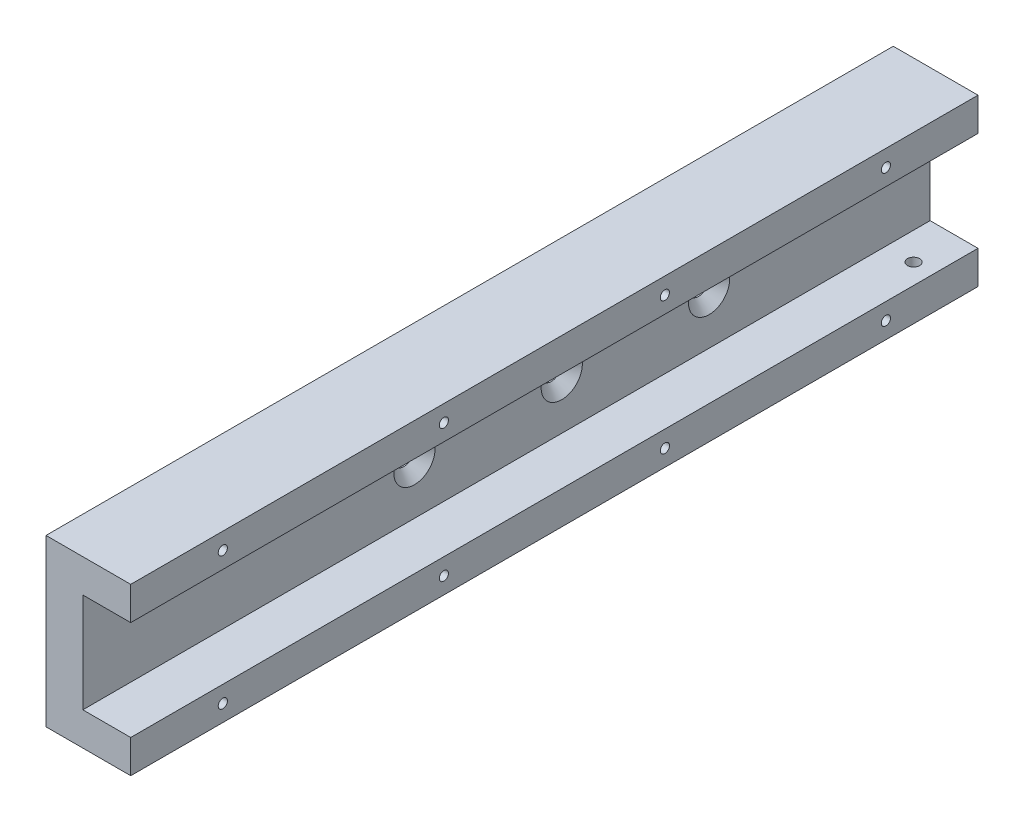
ISO-10303-21;
HEADER;
FILE_DESCRIPTION(('STEP AP214'),'2;1');
FILE_NAME('part.step','',(''),(''),'','','');
FILE_SCHEMA(('AUTOMOTIVE_DESIGN { 1 0 10303 214 1 1 1 1 }'));
ENDSEC;
DATA;
#1=APPLICATION_CONTEXT('core data for automotive mechanical design processes');
#2=APPLICATION_PROTOCOL_DEFINITION('international standard','automotive_design',2000,#1);
#3=PRODUCT_CONTEXT('',#1,'mechanical');
#4=PRODUCT('Part','Part','',(#3));
#5=PRODUCT_RELATED_PRODUCT_CATEGORY('part','',(#4));
#6=PRODUCT_DEFINITION_FORMATION('','',#4);
#7=PRODUCT_DEFINITION_CONTEXT('part definition',#1,'design');
#8=PRODUCT_DEFINITION('design','',#6,#7);
#9=PRODUCT_DEFINITION_SHAPE('','',#8);
#10=(LENGTH_UNIT() NAMED_UNIT(*) SI_UNIT(.MILLI.,.METRE.));
#11=(NAMED_UNIT(*) PLANE_ANGLE_UNIT() SI_UNIT($,.RADIAN.));
#12=(NAMED_UNIT(*) SI_UNIT($,.STERADIAN.) SOLID_ANGLE_UNIT());
#13=UNCERTAINTY_MEASURE_WITH_UNIT(LENGTH_MEASURE(1.E-05),#10,'distance_accuracy_value','');
#14=(GEOMETRIC_REPRESENTATION_CONTEXT(3) GLOBAL_UNCERTAINTY_ASSIGNED_CONTEXT((#13)) GLOBAL_UNIT_ASSIGNED_CONTEXT((#10,
#11,#12)) REPRESENTATION_CONTEXT('',''));
#15=CARTESIAN_POINT('',(0.,0.,0.));
#16=DIRECTION('',(0.,0.,1.));
#17=DIRECTION('',(1.,0.,0.));
#18=AXIS2_PLACEMENT_3D('',#15,#16,#17);
#19=CARTESIAN_POINT('',(95.0000000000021,-13.3541654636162,230.));
#20=DIRECTION('',(1.,0.,0.));
#21=DIRECTION('',(0.,0.,-1.));
#22=AXIS2_PLACEMENT_3D('',#19,#20,#21);
#23=PLANE('',#22);
#24=CARTESIAN_POINT('',(95.0000000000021,9.14583453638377,60.));
#25=DIRECTION('',(1.,0.,0.));
#26=DIRECTION('',(0.,0.,-1.));
#27=AXIS2_PLACEMENT_3D('',#24,#25,#26);
#28=CIRCLE('',#27,2.75);
#29=CARTESIAN_POINT('',(95.0000000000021,9.14583453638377,57.25));
#30=VERTEX_POINT('',#29);
#31=EDGE_CURVE('E240',#30,#30,#28,.T.);
#32=ORIENTED_EDGE('',*,*,#31,.T.);
#33=EDGE_LOOP('',(#32));
#34=FACE_BOUND('',#33,.T.);
#35=CARTESIAN_POINT('',(95.0000000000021,9.14583453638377,100.));
#36=DIRECTION('',(1.,0.,0.));
#37=DIRECTION('',(0.,0.,-1.));
#38=AXIS2_PLACEMENT_3D('',#35,#36,#37);
#39=CIRCLE('',#38,2.75);
#40=CARTESIAN_POINT('',(95.0000000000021,9.14583453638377,97.25));
#41=VERTEX_POINT('',#40);
#42=EDGE_CURVE('E231',#41,#41,#39,.T.);
#43=ORIENTED_EDGE('',*,*,#42,.T.);
#44=EDGE_LOOP('',(#43));
#45=FACE_BOUND('',#44,.T.);
#46=CARTESIAN_POINT('',(95.0000000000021,9.14583453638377,140.));
#47=DIRECTION('',(1.,0.,0.));
#48=DIRECTION('',(0.,0.,-1.));
#49=AXIS2_PLACEMENT_3D('',#46,#47,#48);
#50=CIRCLE('',#49,2.75);
#51=CARTESIAN_POINT('',(95.0000000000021,9.14583453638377,137.25));
#52=VERTEX_POINT('',#51);
#53=EDGE_CURVE('E222',#52,#52,#50,.T.);
#54=ORIENTED_EDGE('',*,*,#53,.T.);
#55=EDGE_LOOP('',(#54));
#56=FACE_BOUND('',#55,.T.);
#57=DIRECTION('',(0.,-1.,0.));
#58=VECTOR('',#57,1.);
#59=CARTESIAN_POINT('',(95.0000000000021,-13.3541654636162,0.));
#60=LINE('',#59,#58);
#61=CARTESIAN_POINT('',(95.0000000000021,31.6458345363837,0.));
#62=VERTEX_POINT('',#61);
#63=CARTESIAN_POINT('',(95.0000000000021,-13.3541654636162,0.));
#64=VERTEX_POINT('',#63);
#65=EDGE_CURVE('E115',#62,#64,#60,.T.);
#66=ORIENTED_EDGE('',*,*,#65,.T.);
#67=DIRECTION('',(0.,0.,-1.));
#68=VECTOR('',#67,1.);
#69=CARTESIAN_POINT('',(95.0000000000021,-13.3541654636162,230.));
#70=LINE('',#69,#68);
#71=CARTESIAN_POINT('',(95.0000000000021,-13.3541654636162,230.));
#72=VERTEX_POINT('',#71);
#73=EDGE_CURVE('E11',#72,#64,#70,.T.);
#74=ORIENTED_EDGE('',*,*,#73,.F.);
#75=DIRECTION('',(0.,-1.,0.));
#76=VECTOR('',#75,1.);
#77=CARTESIAN_POINT('',(95.0000000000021,-13.3541654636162,230.));
#78=LINE('',#77,#76);
#79=CARTESIAN_POINT('',(95.0000000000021,31.6458345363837,230.));
#80=VERTEX_POINT('',#79);
#81=EDGE_CURVE('E130',#80,#72,#78,.T.);
#82=ORIENTED_EDGE('',*,*,#81,.F.);
#83=DIRECTION('',(0.,0.,-1.));
#84=VECTOR('',#83,1.);
#85=CARTESIAN_POINT('',(95.0000000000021,31.6458345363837,230.));
#86=LINE('',#85,#84);
#87=EDGE_CURVE('E111',#80,#62,#86,.T.);
#88=ORIENTED_EDGE('',*,*,#87,.T.);
#89=EDGE_LOOP('',(#66,#74,#82,#88));
#90=FACE_BOUND('',#89,.T.);
#91=ADVANCED_FACE('F16',(#34,#45,#56,#90),#23,.F.);
#92=CARTESIAN_POINT('',(95.0000000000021,-13.3541654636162,230.));
#93=DIRECTION('',(0.,1.,0.));
#94=DIRECTION('',(0.,0.,1.));
#95=AXIS2_PLACEMENT_3D('',#92,#93,#94);
#96=PLANE('',#95);
#97=CARTESIAN_POINT('',(112.5,-13.3541654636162,12.0000000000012));
#98=DIRECTION('',(0.,-1.,0.));
#99=DIRECTION('',(0.,0.,-1.));
#100=AXIS2_PLACEMENT_3D('',#97,#98,#99);
#101=CIRCLE('',#100,1.65);
#102=CARTESIAN_POINT('',(112.5,-13.3541654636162,10.3500000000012));
#103=VERTEX_POINT('',#102);
#104=EDGE_CURVE('E219',#103,#103,#101,.T.);
#105=ORIENTED_EDGE('',*,*,#104,.F.);
#106=EDGE_LOOP('',(#105));
#107=FACE_BOUND('',#106,.T.);
#108=CARTESIAN_POINT('',(100.500000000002,-13.3541654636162,12.0000000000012));
#109=DIRECTION('',(0.,-1.,0.));
#110=DIRECTION('',(0.,0.,-1.));
#111=AXIS2_PLACEMENT_3D('',#108,#109,#110);
#112=CIRCLE('',#111,1.65);
#113=CARTESIAN_POINT('',(100.500000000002,-13.3541654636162,10.3500000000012));
#114=VERTEX_POINT('',#113);
#115=EDGE_CURVE('E213',#114,#114,#112,.T.);
#116=ORIENTED_EDGE('',*,*,#115,.F.);
#117=EDGE_LOOP('',(#116));
#118=FACE_BOUND('',#117,.T.);
#119=DIRECTION('',(1.,0.,0.));
#120=VECTOR('',#119,1.);
#121=CARTESIAN_POINT('',(95.0000000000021,-13.3541654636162,0.));
#122=LINE('',#121,#120);
#123=CARTESIAN_POINT('',(118.000000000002,-13.3541654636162,0.));
#124=VERTEX_POINT('',#123);
#125=EDGE_CURVE('E118',#64,#124,#122,.T.);
#126=ORIENTED_EDGE('',*,*,#125,.T.);
#127=DIRECTION('',(0.,0.,-1.));
#128=VECTOR('',#127,1.);
#129=CARTESIAN_POINT('',(118.000000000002,-13.3541654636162,230.));
#130=LINE('',#129,#128);
#131=CARTESIAN_POINT('',(118.000000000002,-13.3541654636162,230.));
#132=VERTEX_POINT('',#131);
#133=EDGE_CURVE('E24',#132,#124,#130,.T.);
#134=ORIENTED_EDGE('',*,*,#133,.F.);
#135=DIRECTION('',(1.,0.,0.));
#136=VECTOR('',#135,1.);
#137=CARTESIAN_POINT('',(95.0000000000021,-13.3541654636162,230.));
#138=LINE('',#137,#136);
#139=EDGE_CURVE('E76',#72,#132,#138,.T.);
#140=ORIENTED_EDGE('',*,*,#139,.F.);
#141=ORIENTED_EDGE('',*,*,#73,.T.);
#142=EDGE_LOOP('',(#126,#134,#140,#141));
#143=FACE_BOUND('',#142,.T.);
#144=ADVANCED_FACE('F279',(#107,#118,#143),#96,.F.);
#145=CARTESIAN_POINT('',(118.000000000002,-13.3541654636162,230.));
#146=DIRECTION('',(-1.,0.,0.));
#147=DIRECTION('',(0.,0.,1.));
#148=AXIS2_PLACEMENT_3D('',#145,#146,#147);
#149=PLANE('',#148);
#150=CARTESIAN_POINT('',(118.000000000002,-8.85416546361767,205.));
#151=DIRECTION('',(1.,0.,0.));
#152=DIRECTION('',(0.,0.,-1.));
#153=AXIS2_PLACEMENT_3D('',#150,#151,#152);
#154=CIRCLE('',#153,1.25);
#155=CARTESIAN_POINT('',(118.000000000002,-8.85416546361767,203.75));
#156=VERTEX_POINT('',#155);
#157=EDGE_CURVE('E183',#156,#156,#154,.T.);
#158=ORIENTED_EDGE('',*,*,#157,.F.);
#159=EDGE_LOOP('',(#158));
#160=FACE_BOUND('',#159,.T.);
#161=CARTESIAN_POINT('',(118.000000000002,-8.85416546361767,145.));
#162=DIRECTION('',(1.,0.,0.));
#163=DIRECTION('',(0.,0.,-1.));
#164=AXIS2_PLACEMENT_3D('',#161,#162,#163);
#165=CIRCLE('',#164,1.25);
#166=CARTESIAN_POINT('',(118.000000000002,-8.85416546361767,143.75));
#167=VERTEX_POINT('',#166);
#168=EDGE_CURVE('E177',#167,#167,#165,.T.);
#169=ORIENTED_EDGE('',*,*,#168,.F.);
#170=EDGE_LOOP('',(#169));
#171=FACE_BOUND('',#170,.T.);
#172=CARTESIAN_POINT('',(118.000000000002,-8.85416546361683,85.));
#173=DIRECTION('',(1.,0.,0.));
#174=DIRECTION('',(0.,0.,-1.));
#175=AXIS2_PLACEMENT_3D('',#172,#173,#174);
#176=CIRCLE('',#175,1.25);
#177=CARTESIAN_POINT('',(118.000000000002,-8.85416546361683,83.75));
#178=VERTEX_POINT('',#177);
#179=EDGE_CURVE('E171',#178,#178,#176,.T.);
#180=ORIENTED_EDGE('',*,*,#179,.F.);
#181=EDGE_LOOP('',(#180));
#182=FACE_BOUND('',#181,.T.);
#183=CARTESIAN_POINT('',(118.000000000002,-8.85416546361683,25.));
#184=DIRECTION('',(1.,0.,0.));
#185=DIRECTION('',(0.,0.,-1.));
#186=AXIS2_PLACEMENT_3D('',#183,#184,#185);
#187=CIRCLE('',#186,1.25);
#188=CARTESIAN_POINT('',(118.000000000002,-8.85416546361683,23.75));
#189=VERTEX_POINT('',#188);
#190=EDGE_CURVE('E165',#189,#189,#187,.T.);
#191=ORIENTED_EDGE('',*,*,#190,.F.);
#192=EDGE_LOOP('',(#191));
#193=FACE_BOUND('',#192,.T.);
#194=DIRECTION('',(0.,1.,0.));
#195=VECTOR('',#194,1.);
#196=CARTESIAN_POINT('',(118.000000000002,-13.3541654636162,0.));
#197=LINE('',#196,#195);
#198=CARTESIAN_POINT('',(118.000000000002,-4.35416546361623,0.));
#199=VERTEX_POINT('',#198);
#200=EDGE_CURVE('E121',#124,#199,#197,.T.);
#201=ORIENTED_EDGE('',*,*,#200,.T.);
#202=DIRECTION('',(0.,0.,-1.));
#203=VECTOR('',#202,1.);
#204=CARTESIAN_POINT('',(118.000000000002,-4.35416546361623,230.));
#205=LINE('',#204,#203);
#206=CARTESIAN_POINT('',(118.000000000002,-4.35416546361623,230.));
#207=VERTEX_POINT('',#206);
#208=EDGE_CURVE('E137',#207,#199,#205,.T.);
#209=ORIENTED_EDGE('',*,*,#208,.F.);
#210=DIRECTION('',(0.,1.,0.));
#211=VECTOR('',#210,1.);
#212=CARTESIAN_POINT('',(118.000000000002,-13.3541654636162,230.));
#213=LINE('',#212,#211);
#214=EDGE_CURVE('E145',#132,#207,#213,.T.);
#215=ORIENTED_EDGE('',*,*,#214,.F.);
#216=ORIENTED_EDGE('',*,*,#133,.T.);
#217=EDGE_LOOP('',(#201,#209,#215,#216));
#218=FACE_BOUND('',#217,.T.);
#219=ADVANCED_FACE('F143',(#160,#171,#182,#193,#218),#149,.F.);
#220=CARTESIAN_POINT('',(118.000000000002,-4.35416546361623,230.));
#221=DIRECTION('',(0.,-1.,0.));
#222=DIRECTION('',(1.,0.,0.));
#223=AXIS2_PLACEMENT_3D('',#220,#221,#222);
#224=PLANE('',#223);
#225=CARTESIAN_POINT('',(112.5,-4.35416546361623,12.0000000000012));
#226=DIRECTION('',(0.,-1.,0.));
#227=DIRECTION('',(1.,0.,0.));
#228=AXIS2_PLACEMENT_3D('',#225,#226,#227);
#229=CIRCLE('',#228,1.65);
#230=CARTESIAN_POINT('',(114.15,-4.35416546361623,12.0000000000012));
#231=VERTEX_POINT('',#230);
#232=EDGE_CURVE('E216',#231,#231,#229,.T.);
#233=ORIENTED_EDGE('',*,*,#232,.T.);
#234=EDGE_LOOP('',(#233));
#235=FACE_BOUND('',#234,.T.);
#236=DIRECTION('',(-1.,0.,0.));
#237=VECTOR('',#236,1.);
#238=CARTESIAN_POINT('',(118.000000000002,-4.35416546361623,0.));
#239=LINE('',#238,#237);
#240=CARTESIAN_POINT('',(105.000000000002,-4.35416546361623,0.));
#241=VERTEX_POINT('',#240);
#242=EDGE_CURVE('E123',#199,#241,#239,.T.);
#243=ORIENTED_EDGE('',*,*,#242,.T.);
#244=DIRECTION('',(0.,0.,-1.));
#245=VECTOR('',#244,1.);
#246=CARTESIAN_POINT('',(105.000000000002,-4.35416546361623,230.));
#247=LINE('',#246,#245);
#248=CARTESIAN_POINT('',(105.000000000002,-4.35416546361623,230.));
#249=VERTEX_POINT('',#248);
#250=EDGE_CURVE('E134',#249,#241,#247,.T.);
#251=ORIENTED_EDGE('',*,*,#250,.F.);
#252=DIRECTION('',(-1.,0.,0.));
#253=VECTOR('',#252,1.);
#254=CARTESIAN_POINT('',(118.000000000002,-4.35416546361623,230.));
#255=LINE('',#254,#253);
#256=EDGE_CURVE('E157',#207,#249,#255,.T.);
#257=ORIENTED_EDGE('',*,*,#256,.F.);
#258=ORIENTED_EDGE('',*,*,#208,.T.);
#259=EDGE_LOOP('',(#243,#251,#257,#258));
#260=FACE_BOUND('',#259,.T.);
#261=ADVANCED_FACE('F153',(#235,#260),#224,.F.);
#262=CARTESIAN_POINT('',(105.000000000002,-4.35416546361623,230.));
#263=DIRECTION('',(-1.,0.,0.));
#264=DIRECTION('',(0.,0.,1.));
#265=AXIS2_PLACEMENT_3D('',#262,#263,#264);
#266=PLANE('',#265);
#267=CARTESIAN_POINT('',(105.000000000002,9.14583453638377,60.));
#268=DIRECTION('',(1.,0.,0.));
#269=DIRECTION('',(0.,0.,-1.));
#270=AXIS2_PLACEMENT_3D('',#267,#268,#269);
#271=CIRCLE('',#270,5.6);
#272=CARTESIAN_POINT('',(105.000000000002,9.14583453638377,54.4));
#273=VERTEX_POINT('',#272);
#274=EDGE_CURVE('E246',#273,#273,#271,.T.);
#275=ORIENTED_EDGE('',*,*,#274,.F.);
#276=EDGE_LOOP('',(#275));
#277=FACE_BOUND('',#276,.T.);
#278=CARTESIAN_POINT('',(105.000000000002,9.14583453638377,100.));
#279=DIRECTION('',(1.,0.,0.));
#280=DIRECTION('',(0.,0.,-1.));
#281=AXIS2_PLACEMENT_3D('',#278,#279,#280);
#282=CIRCLE('',#281,5.6);
#283=CARTESIAN_POINT('',(105.000000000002,9.14583453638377,94.4));
#284=VERTEX_POINT('',#283);
#285=EDGE_CURVE('E237',#284,#284,#282,.T.);
#286=ORIENTED_EDGE('',*,*,#285,.F.);
#287=EDGE_LOOP('',(#286));
#288=FACE_BOUND('',#287,.T.);
#289=CARTESIAN_POINT('',(105.000000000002,9.14583453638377,140.));
#290=DIRECTION('',(1.,0.,0.));
#291=DIRECTION('',(0.,0.,-1.));
#292=AXIS2_PLACEMENT_3D('',#289,#290,#291);
#293=CIRCLE('',#292,5.6);
#294=CARTESIAN_POINT('',(105.000000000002,9.14583453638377,134.4));
#295=VERTEX_POINT('',#294);
#296=EDGE_CURVE('E228',#295,#295,#293,.T.);
#297=ORIENTED_EDGE('',*,*,#296,.F.);
#298=EDGE_LOOP('',(#297));
#299=FACE_BOUND('',#298,.T.);
#300=DIRECTION('',(0.,1.,0.));
#301=VECTOR('',#300,1.);
#302=CARTESIAN_POINT('',(105.000000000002,-4.35416546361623,0.));
#303=LINE('',#302,#301);
#304=CARTESIAN_POINT('',(105.000000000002,22.6458345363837,0.));
#305=VERTEX_POINT('',#304);
#306=EDGE_CURVE('E125',#241,#305,#303,.T.);
#307=ORIENTED_EDGE('',*,*,#306,.T.);
#308=DIRECTION('',(0.,0.,-1.));
#309=VECTOR('',#308,1.);
#310=CARTESIAN_POINT('',(105.000000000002,22.6458345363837,230.));
#311=LINE('',#310,#309);
#312=CARTESIAN_POINT('',(105.000000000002,22.6458345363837,230.));
#313=VERTEX_POINT('',#312);
#314=EDGE_CURVE('E106',#313,#305,#311,.T.);
#315=ORIENTED_EDGE('',*,*,#314,.F.);
#316=DIRECTION('',(0.,1.,0.));
#317=VECTOR('',#316,1.);
#318=CARTESIAN_POINT('',(105.000000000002,-4.35416546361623,230.));
#319=LINE('',#318,#317);
#320=EDGE_CURVE('E97',#249,#313,#319,.T.);
#321=ORIENTED_EDGE('',*,*,#320,.F.);
#322=ORIENTED_EDGE('',*,*,#250,.T.);
#323=EDGE_LOOP('',(#307,#315,#321,#322));
#324=FACE_BOUND('',#323,.T.);
#325=ADVANCED_FACE('F156',(#277,#288,#299,#324),#266,.F.);
#326=CARTESIAN_POINT('',(118.000000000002,22.6458345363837,230.));
#327=DIRECTION('',(0.,1.,0.));
#328=DIRECTION('',(0.,0.,1.));
#329=AXIS2_PLACEMENT_3D('',#326,#327,#328);
#330=PLANE('',#329);
#331=DIRECTION('',(1.,0.,0.));
#332=VECTOR('',#331,1.);
#333=CARTESIAN_POINT('',(118.000000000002,22.6458345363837,0.));
#334=LINE('',#333,#332);
#335=CARTESIAN_POINT('',(118.000000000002,22.6458345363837,0.));
#336=VERTEX_POINT('',#335);
#337=EDGE_CURVE('E105',#305,#336,#334,.T.);
#338=ORIENTED_EDGE('',*,*,#337,.T.);
#339=DIRECTION('',(0.,0.,-1.));
#340=VECTOR('',#339,1.);
#341=CARTESIAN_POINT('',(118.000000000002,22.6458345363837,230.));
#342=LINE('',#341,#340);
#343=CARTESIAN_POINT('',(118.000000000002,22.6458345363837,230.));
#344=VERTEX_POINT('',#343);
#345=EDGE_CURVE('E102',#344,#336,#342,.T.);
#346=ORIENTED_EDGE('',*,*,#345,.F.);
#347=DIRECTION('',(1.,0.,0.));
#348=VECTOR('',#347,1.);
#349=CARTESIAN_POINT('',(118.000000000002,22.6458345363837,230.));
#350=LINE('',#349,#348);
#351=EDGE_CURVE('E91',#313,#344,#350,.T.);
#352=ORIENTED_EDGE('',*,*,#351,.F.);
#353=ORIENTED_EDGE('',*,*,#314,.T.);
#354=EDGE_LOOP('',(#338,#346,#352,#353));
#355=FACE_BOUND('',#354,.T.);
#356=ADVANCED_FACE('F103',(#355),#330,.F.);
#357=CARTESIAN_POINT('',(118.000000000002,22.6458345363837,230.));
#358=DIRECTION('',(-1.,0.,0.));
#359=DIRECTION('',(0.,-1.,0.));
#360=AXIS2_PLACEMENT_3D('',#357,#358,#359);
#361=PLANE('',#360);
#362=CARTESIAN_POINT('',(118.000000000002,27.1458345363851,25.));
#363=DIRECTION('',(1.,0.,0.));
#364=DIRECTION('',(0.,0.,-1.));
#365=AXIS2_PLACEMENT_3D('',#362,#363,#364);
#366=CIRCLE('',#365,1.24999999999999);
#367=CARTESIAN_POINT('',(118.000000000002,27.1458345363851,23.75));
#368=VERTEX_POINT('',#367);
#369=EDGE_CURVE('E207',#368,#368,#366,.T.);
#370=ORIENTED_EDGE('',*,*,#369,.F.);
#371=EDGE_LOOP('',(#370));
#372=FACE_BOUND('',#371,.T.);
#373=CARTESIAN_POINT('',(118.000000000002,27.1458345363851,85.));
#374=DIRECTION('',(1.,0.,0.));
#375=DIRECTION('',(0.,0.,-1.));
#376=AXIS2_PLACEMENT_3D('',#373,#374,#375);
#377=CIRCLE('',#376,1.24999999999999);
#378=CARTESIAN_POINT('',(118.000000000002,27.1458345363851,83.75));
#379=VERTEX_POINT('',#378);
#380=EDGE_CURVE('E201',#379,#379,#377,.T.);
#381=ORIENTED_EDGE('',*,*,#380,.F.);
#382=EDGE_LOOP('',(#381));
#383=FACE_BOUND('',#382,.T.);
#384=CARTESIAN_POINT('',(118.000000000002,27.1458345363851,145.));
#385=DIRECTION('',(1.,0.,0.));
#386=DIRECTION('',(0.,0.,-1.));
#387=AXIS2_PLACEMENT_3D('',#384,#385,#386);
#388=CIRCLE('',#387,1.24999999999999);
#389=CARTESIAN_POINT('',(118.000000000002,27.1458345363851,143.75));
#390=VERTEX_POINT('',#389);
#391=EDGE_CURVE('E195',#390,#390,#388,.T.);
#392=ORIENTED_EDGE('',*,*,#391,.F.);
#393=EDGE_LOOP('',(#392));
#394=FACE_BOUND('',#393,.T.);
#395=CARTESIAN_POINT('',(118.000000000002,27.1458345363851,205.));
#396=DIRECTION('',(1.,0.,0.));
#397=DIRECTION('',(0.,0.,-1.));
#398=AXIS2_PLACEMENT_3D('',#395,#396,#397);
#399=CIRCLE('',#398,1.24999999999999);
#400=CARTESIAN_POINT('',(118.000000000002,27.1458345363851,203.75));
#401=VERTEX_POINT('',#400);
#402=EDGE_CURVE('E189',#401,#401,#399,.T.);
#403=ORIENTED_EDGE('',*,*,#402,.F.);
#404=EDGE_LOOP('',(#403));
#405=FACE_BOUND('',#404,.T.);
#406=DIRECTION('',(0.,1.,0.));
#407=VECTOR('',#406,1.);
#408=CARTESIAN_POINT('',(118.000000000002,22.6458345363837,0.));
#409=LINE('',#408,#407);
#410=CARTESIAN_POINT('',(118.000000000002,31.6458345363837,0.));
#411=VERTEX_POINT('',#410);
#412=EDGE_CURVE('E62',#336,#411,#409,.T.);
#413=ORIENTED_EDGE('',*,*,#412,.T.);
#414=DIRECTION('',(0.,0.,-1.));
#415=VECTOR('',#414,1.);
#416=CARTESIAN_POINT('',(118.000000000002,31.6458345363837,230.));
#417=LINE('',#416,#415);
#418=CARTESIAN_POINT('',(118.000000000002,31.6458345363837,230.));
#419=VERTEX_POINT('',#418);
#420=EDGE_CURVE('E107',#419,#411,#417,.T.);
#421=ORIENTED_EDGE('',*,*,#420,.F.);
#422=DIRECTION('',(0.,1.,0.));
#423=VECTOR('',#422,1.);
#424=CARTESIAN_POINT('',(118.000000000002,22.6458345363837,230.));
#425=LINE('',#424,#423);
#426=EDGE_CURVE('E95',#344,#419,#425,.T.);
#427=ORIENTED_EDGE('',*,*,#426,.F.);
#428=ORIENTED_EDGE('',*,*,#345,.T.);
#429=EDGE_LOOP('',(#413,#421,#427,#428));
#430=FACE_BOUND('',#429,.T.);
#431=ADVANCED_FACE('F109',(#372,#383,#394,#405,#430),#361,.F.);
#432=CARTESIAN_POINT('',(95.0000000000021,31.6458345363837,230.));
#433=DIRECTION('',(0.,-1.,0.));
#434=DIRECTION('',(0.,0.,-1.));
#435=AXIS2_PLACEMENT_3D('',#432,#433,#434);
#436=PLANE('',#435);
#437=DIRECTION('',(-1.,0.,0.));
#438=VECTOR('',#437,1.);
#439=CARTESIAN_POINT('',(95.0000000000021,31.6458345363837,0.));
#440=LINE('',#439,#438);
#441=EDGE_CURVE('E68',#411,#62,#440,.T.);
#442=ORIENTED_EDGE('',*,*,#441,.T.);
#443=ORIENTED_EDGE('',*,*,#87,.F.);
#444=DIRECTION('',(-1.,0.,0.));
#445=VECTOR('',#444,1.);
#446=CARTESIAN_POINT('',(95.0000000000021,31.6458345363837,230.));
#447=LINE('',#446,#445);
#448=EDGE_CURVE('E32',#419,#80,#447,.T.);
#449=ORIENTED_EDGE('',*,*,#448,.F.);
#450=ORIENTED_EDGE('',*,*,#420,.T.);
#451=EDGE_LOOP('',(#442,#443,#449,#450));
#452=FACE_BOUND('',#451,.T.);
#453=ADVANCED_FACE('F294',(#452),#436,.F.);
#454=CARTESIAN_POINT('',(0.,0.,230.));
#455=DIRECTION('',(0.,0.,-1.));
#456=DIRECTION('',(-1.,0.,0.));
#457=AXIS2_PLACEMENT_3D('',#454,#455,#456);
#458=PLANE('',#457);
#459=ORIENTED_EDGE('',*,*,#81,.T.);
#460=ORIENTED_EDGE('',*,*,#139,.T.);
#461=ORIENTED_EDGE('',*,*,#214,.T.);
#462=ORIENTED_EDGE('',*,*,#256,.T.);
#463=ORIENTED_EDGE('',*,*,#320,.T.);
#464=ORIENTED_EDGE('',*,*,#351,.T.);
#465=ORIENTED_EDGE('',*,*,#426,.T.);
#466=ORIENTED_EDGE('',*,*,#448,.T.);
#467=EDGE_LOOP('',(#459,#460,#461,#462,#463,#464,#465,#466));
#468=FACE_BOUND('',#467,.T.);
#469=ADVANCED_FACE('F93',(#468),#458,.F.);
#470=CARTESIAN_POINT('',(0.,0.,0.));
#471=DIRECTION('',(0.,0.,-1.));
#472=DIRECTION('',(-1.,0.,0.));
#473=AXIS2_PLACEMENT_3D('',#470,#471,#472);
#474=PLANE('',#473);
#475=ORIENTED_EDGE('',*,*,#65,.F.);
#476=ORIENTED_EDGE('',*,*,#441,.F.);
#477=ORIENTED_EDGE('',*,*,#412,.F.);
#478=ORIENTED_EDGE('',*,*,#337,.F.);
#479=ORIENTED_EDGE('',*,*,#306,.F.);
#480=ORIENTED_EDGE('',*,*,#242,.F.);
#481=ORIENTED_EDGE('',*,*,#200,.F.);
#482=ORIENTED_EDGE('',*,*,#125,.F.);
#483=EDGE_LOOP('',(#475,#476,#477,#478,#479,#480,#481,#482));
#484=FACE_BOUND('',#483,.T.);
#485=ADVANCED_FACE('F149',(#484),#474,.T.);
#486=CARTESIAN_POINT('',(105.500000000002,-8.85416546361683,25.));
#487=DIRECTION('',(1.,0.,0.));
#488=DIRECTION('',(0.,0.,-1.));
#489=AXIS2_PLACEMENT_3D('',#486,#487,#488);
#490=CONICAL_SURFACE('',#489,1.25,1.02974425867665);
#491=CARTESIAN_POINT('',(104.748924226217,-8.85416546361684,25.));
#492=VERTEX_POINT('',#491);
#493=VERTEX_LOOP('',#492);
#494=FACE_BOUND('',#493,.T.);
#495=CARTESIAN_POINT('',(105.500000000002,-8.85416546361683,25.));
#496=DIRECTION('',(1.,0.,0.));
#497=DIRECTION('',(0.,0.,-1.));
#498=AXIS2_PLACEMENT_3D('',#495,#496,#497);
#499=CIRCLE('',#498,1.25);
#500=CARTESIAN_POINT('',(105.500000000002,-8.85416546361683,23.75));
#501=VERTEX_POINT('',#500);
#502=EDGE_CURVE('E119',#501,#501,#499,.T.);
#503=ORIENTED_EDGE('',*,*,#502,.T.);
#504=EDGE_LOOP('',(#503));
#505=FACE_BOUND('',#504,.T.);
#506=ADVANCED_FACE('F328',(#494,#505),#490,.F.);
#507=CARTESIAN_POINT('',(118.000000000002,-8.85416546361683,25.));
#508=DIRECTION('',(1.,0.,0.));
#509=DIRECTION('',(0.,0.,-1.));
#510=AXIS2_PLACEMENT_3D('',#507,#508,#509);
#511=CYLINDRICAL_SURFACE('',#510,1.25);
#512=ORIENTED_EDGE('',*,*,#502,.F.);
#513=EDGE_LOOP('',(#512));
#514=FACE_BOUND('',#513,.T.);
#515=ORIENTED_EDGE('',*,*,#190,.T.);
#516=EDGE_LOOP('',(#515));
#517=FACE_BOUND('',#516,.T.);
#518=ADVANCED_FACE('F325',(#514,#517),#511,.F.);
#519=CARTESIAN_POINT('',(105.500000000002,-8.85416546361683,85.));
#520=DIRECTION('',(1.,0.,0.));
#521=DIRECTION('',(0.,0.,-1.));
#522=AXIS2_PLACEMENT_3D('',#519,#520,#521);
#523=CONICAL_SURFACE('',#522,1.25,1.02974425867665);
#524=CARTESIAN_POINT('',(104.748924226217,-8.85416546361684,85.));
#525=VERTEX_POINT('',#524);
#526=VERTEX_LOOP('',#525);
#527=FACE_BOUND('',#526,.T.);
#528=CARTESIAN_POINT('',(105.500000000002,-8.85416546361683,85.));
#529=DIRECTION('',(1.,0.,0.));
#530=DIRECTION('',(0.,0.,-1.));
#531=AXIS2_PLACEMENT_3D('',#528,#529,#530);
#532=CIRCLE('',#531,1.25);
#533=CARTESIAN_POINT('',(105.500000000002,-8.85416546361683,83.75));
#534=VERTEX_POINT('',#533);
#535=EDGE_CURVE('E168',#534,#534,#532,.T.);
#536=ORIENTED_EDGE('',*,*,#535,.T.);
#537=EDGE_LOOP('',(#536));
#538=FACE_BOUND('',#537,.T.);
#539=ADVANCED_FACE('F327',(#527,#538),#523,.F.);
#540=CARTESIAN_POINT('',(118.000000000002,-8.85416546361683,85.));
#541=DIRECTION('',(1.,0.,0.));
#542=DIRECTION('',(0.,0.,-1.));
#543=AXIS2_PLACEMENT_3D('',#540,#541,#542);
#544=CYLINDRICAL_SURFACE('',#543,1.25);
#545=ORIENTED_EDGE('',*,*,#535,.F.);
#546=EDGE_LOOP('',(#545));
#547=FACE_BOUND('',#546,.T.);
#548=ORIENTED_EDGE('',*,*,#179,.T.);
#549=EDGE_LOOP('',(#548));
#550=FACE_BOUND('',#549,.T.);
#551=ADVANCED_FACE('F336',(#547,#550),#544,.F.);
#552=CARTESIAN_POINT('',(105.500000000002,-8.85416546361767,145.));
#553=DIRECTION('',(1.,0.,0.));
#554=DIRECTION('',(0.,0.,-1.));
#555=AXIS2_PLACEMENT_3D('',#552,#553,#554);
#556=CONICAL_SURFACE('',#555,1.25,1.02974425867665);
#557=CARTESIAN_POINT('',(104.748924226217,-8.85416546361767,145.));
#558=VERTEX_POINT('',#557);
#559=VERTEX_LOOP('',#558);
#560=FACE_BOUND('',#559,.T.);
#561=CARTESIAN_POINT('',(105.500000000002,-8.85416546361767,145.));
#562=DIRECTION('',(1.,0.,0.));
#563=DIRECTION('',(0.,0.,-1.));
#564=AXIS2_PLACEMENT_3D('',#561,#562,#563);
#565=CIRCLE('',#564,1.25);
#566=CARTESIAN_POINT('',(105.500000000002,-8.85416546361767,143.75));
#567=VERTEX_POINT('',#566);
#568=EDGE_CURVE('E174',#567,#567,#565,.T.);
#569=ORIENTED_EDGE('',*,*,#568,.T.);
#570=EDGE_LOOP('',(#569));
#571=FACE_BOUND('',#570,.T.);
#572=ADVANCED_FACE('F345',(#560,#571),#556,.F.);
#573=CARTESIAN_POINT('',(118.000000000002,-8.85416546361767,145.));
#574=DIRECTION('',(1.,0.,0.));
#575=DIRECTION('',(0.,0.,-1.));
#576=AXIS2_PLACEMENT_3D('',#573,#574,#575);
#577=CYLINDRICAL_SURFACE('',#576,1.25);
#578=ORIENTED_EDGE('',*,*,#568,.F.);
#579=EDGE_LOOP('',(#578));
#580=FACE_BOUND('',#579,.T.);
#581=ORIENTED_EDGE('',*,*,#168,.T.);
#582=EDGE_LOOP('',(#581));
#583=FACE_BOUND('',#582,.T.);
#584=ADVANCED_FACE('F349',(#580,#583),#577,.F.);
#585=CARTESIAN_POINT('',(105.500000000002,-8.85416546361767,205.));
#586=DIRECTION('',(1.,0.,0.));
#587=DIRECTION('',(0.,0.,-1.));
#588=AXIS2_PLACEMENT_3D('',#585,#586,#587);
#589=CONICAL_SURFACE('',#588,1.25,1.02974425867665);
#590=CARTESIAN_POINT('',(104.748924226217,-8.85416546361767,205.));
#591=VERTEX_POINT('',#590);
#592=VERTEX_LOOP('',#591);
#593=FACE_BOUND('',#592,.T.);
#594=CARTESIAN_POINT('',(105.500000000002,-8.85416546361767,205.));
#595=DIRECTION('',(1.,0.,0.));
#596=DIRECTION('',(0.,0.,-1.));
#597=AXIS2_PLACEMENT_3D('',#594,#595,#596);
#598=CIRCLE('',#597,1.25);
#599=CARTESIAN_POINT('',(105.500000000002,-8.85416546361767,203.75));
#600=VERTEX_POINT('',#599);
#601=EDGE_CURVE('E180',#600,#600,#598,.T.);
#602=ORIENTED_EDGE('',*,*,#601,.T.);
#603=EDGE_LOOP('',(#602));
#604=FACE_BOUND('',#603,.T.);
#605=ADVANCED_FACE('F353',(#593,#604),#589,.F.);
#606=CARTESIAN_POINT('',(118.000000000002,-8.85416546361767,205.));
#607=DIRECTION('',(1.,0.,0.));
#608=DIRECTION('',(0.,0.,-1.));
#609=AXIS2_PLACEMENT_3D('',#606,#607,#608);
#610=CYLINDRICAL_SURFACE('',#609,1.25);
#611=ORIENTED_EDGE('',*,*,#601,.F.);
#612=EDGE_LOOP('',(#611));
#613=FACE_BOUND('',#612,.T.);
#614=ORIENTED_EDGE('',*,*,#157,.T.);
#615=EDGE_LOOP('',(#614));
#616=FACE_BOUND('',#615,.T.);
#617=ADVANCED_FACE('F357',(#613,#616),#610,.F.);
#618=CARTESIAN_POINT('',(105.500000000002,27.1458345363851,205.));
#619=DIRECTION('',(1.,0.,0.));
#620=DIRECTION('',(0.,0.,-1.));
#621=AXIS2_PLACEMENT_3D('',#618,#619,#620);
#622=CONICAL_SURFACE('',#621,1.25,1.02974425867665);
#623=CARTESIAN_POINT('',(104.748924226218,27.1458345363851,205.));
#624=VERTEX_POINT('',#623);
#625=VERTEX_LOOP('',#624);
#626=FACE_BOUND('',#625,.T.);
#627=CARTESIAN_POINT('',(105.500000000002,27.1458345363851,205.));
#628=DIRECTION('',(1.,0.,0.));
#629=DIRECTION('',(0.,0.,-1.));
#630=AXIS2_PLACEMENT_3D('',#627,#628,#629);
#631=CIRCLE('',#630,1.25);
#632=CARTESIAN_POINT('',(105.500000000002,27.1458345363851,203.75));
#633=VERTEX_POINT('',#632);
#634=EDGE_CURVE('E186',#633,#633,#631,.T.);
#635=ORIENTED_EDGE('',*,*,#634,.T.);
#636=EDGE_LOOP('',(#635));
#637=FACE_BOUND('',#636,.T.);
#638=ADVANCED_FACE('F361',(#626,#637),#622,.F.);
#639=CARTESIAN_POINT('',(118.000000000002,27.1458345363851,205.));
#640=DIRECTION('',(1.,0.,0.));
#641=DIRECTION('',(0.,0.,-1.));
#642=AXIS2_PLACEMENT_3D('',#639,#640,#641);
#643=CYLINDRICAL_SURFACE('',#642,1.25);
#644=ORIENTED_EDGE('',*,*,#634,.F.);
#645=EDGE_LOOP('',(#644));
#646=FACE_BOUND('',#645,.T.);
#647=ORIENTED_EDGE('',*,*,#402,.T.);
#648=EDGE_LOOP('',(#647));
#649=FACE_BOUND('',#648,.T.);
#650=ADVANCED_FACE('F365',(#646,#649),#643,.F.);
#651=CARTESIAN_POINT('',(105.500000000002,27.1458345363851,145.));
#652=DIRECTION('',(1.,0.,0.));
#653=DIRECTION('',(0.,0.,-1.));
#654=AXIS2_PLACEMENT_3D('',#651,#652,#653);
#655=CONICAL_SURFACE('',#654,1.25,1.02974425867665);
#656=CARTESIAN_POINT('',(104.748924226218,27.1458345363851,145.));
#657=VERTEX_POINT('',#656);
#658=VERTEX_LOOP('',#657);
#659=FACE_BOUND('',#658,.T.);
#660=CARTESIAN_POINT('',(105.500000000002,27.1458345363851,145.));
#661=DIRECTION('',(1.,0.,0.));
#662=DIRECTION('',(0.,0.,-1.));
#663=AXIS2_PLACEMENT_3D('',#660,#661,#662);
#664=CIRCLE('',#663,1.25);
#665=CARTESIAN_POINT('',(105.500000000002,27.1458345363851,143.75));
#666=VERTEX_POINT('',#665);
#667=EDGE_CURVE('E192',#666,#666,#664,.T.);
#668=ORIENTED_EDGE('',*,*,#667,.T.);
#669=EDGE_LOOP('',(#668));
#670=FACE_BOUND('',#669,.T.);
#671=ADVANCED_FACE('F369',(#659,#670),#655,.F.);
#672=CARTESIAN_POINT('',(118.000000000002,27.1458345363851,145.));
#673=DIRECTION('',(1.,0.,0.));
#674=DIRECTION('',(0.,0.,-1.));
#675=AXIS2_PLACEMENT_3D('',#672,#673,#674);
#676=CYLINDRICAL_SURFACE('',#675,1.25);
#677=ORIENTED_EDGE('',*,*,#667,.F.);
#678=EDGE_LOOP('',(#677));
#679=FACE_BOUND('',#678,.T.);
#680=ORIENTED_EDGE('',*,*,#391,.T.);
#681=EDGE_LOOP('',(#680));
#682=FACE_BOUND('',#681,.T.);
#683=ADVANCED_FACE('F373',(#679,#682),#676,.F.);
#684=CARTESIAN_POINT('',(105.500000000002,27.1458345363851,85.));
#685=DIRECTION('',(1.,0.,0.));
#686=DIRECTION('',(0.,0.,-1.));
#687=AXIS2_PLACEMENT_3D('',#684,#685,#686);
#688=CONICAL_SURFACE('',#687,1.25,1.02974425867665);
#689=CARTESIAN_POINT('',(104.748924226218,27.1458345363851,85.));
#690=VERTEX_POINT('',#689);
#691=VERTEX_LOOP('',#690);
#692=FACE_BOUND('',#691,.T.);
#693=CARTESIAN_POINT('',(105.500000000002,27.1458345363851,85.));
#694=DIRECTION('',(1.,0.,0.));
#695=DIRECTION('',(0.,0.,-1.));
#696=AXIS2_PLACEMENT_3D('',#693,#694,#695);
#697=CIRCLE('',#696,1.25);
#698=CARTESIAN_POINT('',(105.500000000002,27.1458345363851,83.75));
#699=VERTEX_POINT('',#698);
#700=EDGE_CURVE('E198',#699,#699,#697,.T.);
#701=ORIENTED_EDGE('',*,*,#700,.T.);
#702=EDGE_LOOP('',(#701));
#703=FACE_BOUND('',#702,.T.);
#704=ADVANCED_FACE('F377',(#692,#703),#688,.F.);
#705=CARTESIAN_POINT('',(118.000000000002,27.1458345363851,85.));
#706=DIRECTION('',(1.,0.,0.));
#707=DIRECTION('',(0.,0.,-1.));
#708=AXIS2_PLACEMENT_3D('',#705,#706,#707);
#709=CYLINDRICAL_SURFACE('',#708,1.25);
#710=ORIENTED_EDGE('',*,*,#700,.F.);
#711=EDGE_LOOP('',(#710));
#712=FACE_BOUND('',#711,.T.);
#713=ORIENTED_EDGE('',*,*,#380,.T.);
#714=EDGE_LOOP('',(#713));
#715=FACE_BOUND('',#714,.T.);
#716=ADVANCED_FACE('F381',(#712,#715),#709,.F.);
#717=CARTESIAN_POINT('',(105.500000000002,27.1458345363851,25.));
#718=DIRECTION('',(1.,0.,0.));
#719=DIRECTION('',(0.,0.,-1.));
#720=AXIS2_PLACEMENT_3D('',#717,#718,#719);
#721=CONICAL_SURFACE('',#720,1.25,1.02974425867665);
#722=CARTESIAN_POINT('',(104.748924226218,27.1458345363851,25.));
#723=VERTEX_POINT('',#722);
#724=VERTEX_LOOP('',#723);
#725=FACE_BOUND('',#724,.T.);
#726=CARTESIAN_POINT('',(105.500000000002,27.1458345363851,25.));
#727=DIRECTION('',(1.,0.,0.));
#728=DIRECTION('',(0.,0.,-1.));
#729=AXIS2_PLACEMENT_3D('',#726,#727,#728);
#730=CIRCLE('',#729,1.25);
#731=CARTESIAN_POINT('',(105.500000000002,27.1458345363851,23.75));
#732=VERTEX_POINT('',#731);
#733=EDGE_CURVE('E204',#732,#732,#730,.T.);
#734=ORIENTED_EDGE('',*,*,#733,.T.);
#735=EDGE_LOOP('',(#734));
#736=FACE_BOUND('',#735,.T.);
#737=ADVANCED_FACE('F385',(#725,#736),#721,.F.);
#738=CARTESIAN_POINT('',(118.000000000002,27.1458345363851,25.));
#739=DIRECTION('',(1.,0.,0.));
#740=DIRECTION('',(0.,0.,-1.));
#741=AXIS2_PLACEMENT_3D('',#738,#739,#740);
#742=CYLINDRICAL_SURFACE('',#741,1.25);
#743=ORIENTED_EDGE('',*,*,#733,.F.);
#744=EDGE_LOOP('',(#743));
#745=FACE_BOUND('',#744,.T.);
#746=ORIENTED_EDGE('',*,*,#369,.T.);
#747=EDGE_LOOP('',(#746));
#748=FACE_BOUND('',#747,.T.);
#749=ADVANCED_FACE('F389',(#745,#748),#742,.F.);
#750=CARTESIAN_POINT('',(100.500000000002,-1.85416546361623,12.0000000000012));
#751=DIRECTION('',(0.,-1.,0.));
#752=DIRECTION('',(0.,0.,-1.));
#753=AXIS2_PLACEMENT_3D('',#750,#751,#752);
#754=CONICAL_SURFACE('',#753,1.65,1.02974425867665);
#755=CARTESIAN_POINT('',(100.500000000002,-0.862745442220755,12.0000000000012));
#756=VERTEX_POINT('',#755);
#757=VERTEX_LOOP('',#756);
#758=FACE_BOUND('',#757,.T.);
#759=CARTESIAN_POINT('',(100.500000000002,-1.85416546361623,12.0000000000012));
#760=DIRECTION('',(0.,-1.,0.));
#761=DIRECTION('',(0.,0.,-1.));
#762=AXIS2_PLACEMENT_3D('',#759,#760,#761);
#763=CIRCLE('',#762,1.65);
#764=CARTESIAN_POINT('',(100.500000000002,-1.85416546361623,10.3500000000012));
#765=VERTEX_POINT('',#764);
#766=EDGE_CURVE('E210',#765,#765,#763,.T.);
#767=ORIENTED_EDGE('',*,*,#766,.T.);
#768=EDGE_LOOP('',(#767));
#769=FACE_BOUND('',#768,.T.);
#770=ADVANCED_FACE('F393',(#758,#769),#754,.F.);
#771=CARTESIAN_POINT('',(100.500000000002,-13.3541654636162,12.0000000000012));
#772=DIRECTION('',(0.,-1.,0.));
#773=DIRECTION('',(0.,0.,-1.));
#774=AXIS2_PLACEMENT_3D('',#771,#772,#773);
#775=CYLINDRICAL_SURFACE('',#774,1.65);
#776=ORIENTED_EDGE('',*,*,#766,.F.);
#777=EDGE_LOOP('',(#776));
#778=FACE_BOUND('',#777,.T.);
#779=ORIENTED_EDGE('',*,*,#115,.T.);
#780=EDGE_LOOP('',(#779));
#781=FACE_BOUND('',#780,.T.);
#782=ADVANCED_FACE('F397',(#778,#781),#775,.F.);
#783=CARTESIAN_POINT('',(112.5,-13.3541654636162,12.0000000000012));
#784=DIRECTION('',(0.,-1.,0.));
#785=DIRECTION('',(0.,0.,-1.));
#786=AXIS2_PLACEMENT_3D('',#783,#784,#785);
#787=CYLINDRICAL_SURFACE('',#786,1.65);
#788=ORIENTED_EDGE('',*,*,#104,.T.);
#789=EDGE_LOOP('',(#788));
#790=FACE_BOUND('',#789,.T.);
#791=ORIENTED_EDGE('',*,*,#232,.F.);
#792=EDGE_LOOP('',(#791));
#793=FACE_BOUND('',#792,.T.);
#794=ADVANCED_FACE('F274',(#790,#793),#787,.F.);
#795=CARTESIAN_POINT('',(105.000000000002,9.14583453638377,140.));
#796=DIRECTION('',(1.,0.,0.));
#797=DIRECTION('',(0.,0.,-1.));
#798=AXIS2_PLACEMENT_3D('',#795,#796,#797);
#799=CYLINDRICAL_SURFACE('',#798,2.75);
#800=ORIENTED_EDGE('',*,*,#53,.F.);
#801=EDGE_LOOP('',(#800));
#802=FACE_BOUND('',#801,.T.);
#803=CARTESIAN_POINT('',(102.150000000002,9.14583453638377,140.));
#804=DIRECTION('',(1.,0.,0.));
#805=DIRECTION('',(0.,0.,-1.));
#806=AXIS2_PLACEMENT_3D('',#803,#804,#805);
#807=CIRCLE('',#806,2.75);
#808=CARTESIAN_POINT('',(102.150000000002,9.14583453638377,137.25));
#809=VERTEX_POINT('',#808);
#810=EDGE_CURVE('E225',#809,#809,#807,.T.);
#811=ORIENTED_EDGE('',*,*,#810,.T.);
#812=EDGE_LOOP('',(#811));
#813=FACE_BOUND('',#812,.T.);
#814=ADVANCED_FACE('F262',(#802,#813),#799,.F.);
#815=CARTESIAN_POINT('',(105.000000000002,9.14583453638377,140.));
#816=DIRECTION('',(1.,0.,0.));
#817=DIRECTION('',(0.,0.,-1.));
#818=AXIS2_PLACEMENT_3D('',#815,#816,#817);
#819=CONICAL_SURFACE('',#818,5.6,0.78539816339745);
#820=ORIENTED_EDGE('',*,*,#810,.F.);
#821=EDGE_LOOP('',(#820));
#822=FACE_BOUND('',#821,.T.);
#823=ORIENTED_EDGE('',*,*,#296,.T.);
#824=EDGE_LOOP('',(#823));
#825=FACE_BOUND('',#824,.T.);
#826=ADVANCED_FACE('F259',(#822,#825),#819,.F.);
#827=CARTESIAN_POINT('',(105.000000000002,9.14583453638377,100.));
#828=DIRECTION('',(1.,0.,0.));
#829=DIRECTION('',(0.,0.,-1.));
#830=AXIS2_PLACEMENT_3D('',#827,#828,#829);
#831=CYLINDRICAL_SURFACE('',#830,2.75);
#832=ORIENTED_EDGE('',*,*,#42,.F.);
#833=EDGE_LOOP('',(#832));
#834=FACE_BOUND('',#833,.T.);
#835=CARTESIAN_POINT('',(102.150000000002,9.14583453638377,100.));
#836=DIRECTION('',(1.,0.,0.));
#837=DIRECTION('',(0.,0.,-1.));
#838=AXIS2_PLACEMENT_3D('',#835,#836,#837);
#839=CIRCLE('',#838,2.75);
#840=CARTESIAN_POINT('',(102.150000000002,9.14583453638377,97.25));
#841=VERTEX_POINT('',#840);
#842=EDGE_CURVE('E234',#841,#841,#839,.T.);
#843=ORIENTED_EDGE('',*,*,#842,.T.);
#844=EDGE_LOOP('',(#843));
#845=FACE_BOUND('',#844,.T.);
#846=ADVANCED_FACE('F261',(#834,#845),#831,.F.);
#847=CARTESIAN_POINT('',(105.000000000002,9.14583453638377,100.));
#848=DIRECTION('',(1.,0.,0.));
#849=DIRECTION('',(0.,0.,-1.));
#850=AXIS2_PLACEMENT_3D('',#847,#848,#849);
#851=CONICAL_SURFACE('',#850,5.6,0.78539816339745);
#852=ORIENTED_EDGE('',*,*,#842,.F.);
#853=EDGE_LOOP('',(#852));
#854=FACE_BOUND('',#853,.T.);
#855=ORIENTED_EDGE('',*,*,#285,.T.);
#856=EDGE_LOOP('',(#855));
#857=FACE_BOUND('',#856,.T.);
#858=ADVANCED_FACE('F271',(#854,#857),#851,.F.);
#859=CARTESIAN_POINT('',(105.000000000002,9.14583453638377,60.));
#860=DIRECTION('',(1.,0.,0.));
#861=DIRECTION('',(0.,0.,-1.));
#862=AXIS2_PLACEMENT_3D('',#859,#860,#861);
#863=CYLINDRICAL_SURFACE('',#862,2.75);
#864=ORIENTED_EDGE('',*,*,#31,.F.);
#865=EDGE_LOOP('',(#864));
#866=FACE_BOUND('',#865,.T.);
#867=CARTESIAN_POINT('',(102.150000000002,9.14583453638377,60.));
#868=DIRECTION('',(1.,0.,0.));
#869=DIRECTION('',(0.,0.,-1.));
#870=AXIS2_PLACEMENT_3D('',#867,#868,#869);
#871=CIRCLE('',#870,2.75);
#872=CARTESIAN_POINT('',(102.150000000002,9.14583453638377,57.25));
#873=VERTEX_POINT('',#872);
#874=EDGE_CURVE('E243',#873,#873,#871,.T.);
#875=ORIENTED_EDGE('',*,*,#874,.T.);
#876=EDGE_LOOP('',(#875));
#877=FACE_BOUND('',#876,.T.);
#878=ADVANCED_FACE('F445',(#866,#877),#863,.F.);
#879=CARTESIAN_POINT('',(105.000000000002,9.14583453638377,60.));
#880=DIRECTION('',(1.,0.,0.));
#881=DIRECTION('',(0.,0.,-1.));
#882=AXIS2_PLACEMENT_3D('',#879,#880,#881);
#883=CONICAL_SURFACE('',#882,5.6,0.78539816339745);
#884=ORIENTED_EDGE('',*,*,#874,.F.);
#885=EDGE_LOOP('',(#884));
#886=FACE_BOUND('',#885,.T.);
#887=ORIENTED_EDGE('',*,*,#274,.T.);
#888=EDGE_LOOP('',(#887));
#889=FACE_BOUND('',#888,.T.);
#890=ADVANCED_FACE('F250',(#886,#889),#883,.F.);
#891=CLOSED_SHELL('',(#91,#144,#219,#261,#325,#356,#431,#453,#469,#485,#506,#518,#539,#551,#572,
#584,#605,#617,#638,#650,#671,#683,#704,#716,#737,#749,#770,#782,#794,#814,#826,#846,#858,#878,#890));
#892=MANIFOLD_SOLID_BREP('B1',#891);
#893=ADVANCED_BREP_SHAPE_REPRESENTATION('',(#18,#892),#14);
#894=SHAPE_DEFINITION_REPRESENTATION(#9,#893);
ENDSEC;
END-ISO-10303-21;
